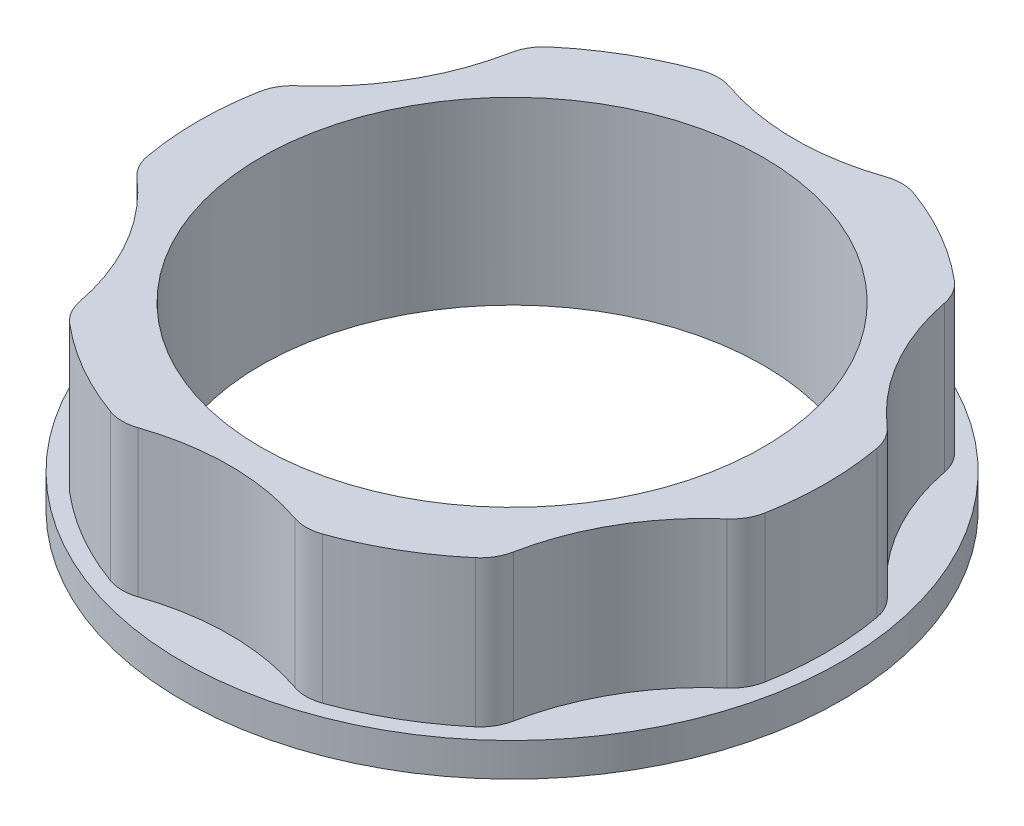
from build123d import *
from build123d.topology import SkipClean

# Parameters (mm, degrees)
ESQUISSE1_R        = 12
BOSS_EXTRU_1_DEPTH = 7
BOSS_EXTRU_2_START = 1.6
ESQUISSE2_R        = 15.75
ESQUISSE2_R_2      = 12
BOSS_EXTRU_2_DEPTH = 1.6


with BuildPart() as part:
    # Esquisse1 → Boss.-Extru.1 (new body)
    with BuildSketch(Plane(origin=(0, 0, 0), x_dir=(1, 0, 0), z_dir=(0, 1, 0))):
        with BuildLine():
            ThreePointArc((-5.069676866, 14.117307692), (-7.5, 12.990381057), (-9.691108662, 11.449122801))
            ThreePointArc((-9.691108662, 11.449122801), (-10.12433899, 10.934042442), (-10.362171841, 10.304414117))
            ThreePointArc((-10.362171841, 10.304414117), (-11.691342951, 6.75), (-14.104970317, 3.821696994))
            ThreePointArc((-14.104970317, 3.821696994), (-14.531328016, 3.30091354), (-14.760785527, 2.668184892))
            ThreePointArc((-14.760785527, 2.668184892), (-15, 0), (-14.760785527, -2.668184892))
            ThreePointArc((-14.760785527, -2.668184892), (-14.531328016, -3.30091354), (-14.104970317, -3.821696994))
            ThreePointArc((-14.104970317, -3.821696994), (-11.691342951, -6.75), (-10.362171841, -10.304414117))
            ThreePointArc((-10.362171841, -10.304414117), (-10.12433899, -10.934042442), (-9.691108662, -11.449122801))
            ThreePointArc((-9.691108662, -11.449122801), (-7.5, -12.990381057), (-5.069676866, -14.117307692))
            ThreePointArc((-5.069676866, -14.117307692), (-4.406989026, -14.234955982), (-3.742798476, -14.126111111))
            ThreePointArc((-3.742798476, -14.126111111), (0, -13.5), (3.742798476, -14.126111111))
            ThreePointArc((3.742798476, -14.126111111), (4.406989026, -14.234955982), (5.069676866, -14.117307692))
            ThreePointArc((5.069676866, -14.117307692), (7.5, -12.990381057), (9.691108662, -11.449122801))
            ThreePointArc((9.691108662, -11.449122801), (10.12433899, -10.934042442), (10.362171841, -10.304414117))
            ThreePointArc((10.362171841, -10.304414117), (11.691342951, -6.75), (14.104970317, -3.821696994))
            ThreePointArc((14.104970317, -3.821696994), (14.531328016, -3.30091354), (14.760785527, -2.668184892))
            ThreePointArc((14.760785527, -2.668184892), (15, 0), (14.760785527, 2.668184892))
            ThreePointArc((14.760785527, 2.668184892), (14.531328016, 3.30091354), (14.104970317, 3.821696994))
            ThreePointArc((14.104970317, 3.821696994), (11.691342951, 6.75), (10.362171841, 10.304414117))
            ThreePointArc((10.362171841, 10.304414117), (10.12433899, 10.934042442), (9.691108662, 11.449122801))
            ThreePointArc((9.691108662, 11.449122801), (7.5, 12.990381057), (5.069676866, 14.117307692))
            ThreePointArc((5.069676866, 14.117307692), (4.406989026, 14.234955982), (3.742798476, 14.126111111))
            ThreePointArc((3.742798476, 14.126111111), (0, 13.5), (-3.742798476, 14.126111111))
            ThreePointArc((-3.742798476, 14.126111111), (-4.406989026, 14.234955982), (-5.069676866, 14.117307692))
        make_face()
        with Locations(Location((0, 0, 0), (0, 0, 270))):
            Circle(ESQUISSE1_R, mode=Mode.SUBTRACT)
    extrude(amount=BOSS_EXTRU_1_DEPTH)

    # Esquisse2 → Boss.-Extru.2 (add)
    with SkipClean():  # the faces are left unmerged after this step: merging them gives an invalid solid
        with BuildSketch(Plane.XZ.offset(BOSS_EXTRU_2_START)):
            with Locations(Location((0, 0, 0), (0, 0, 270))):
                Circle(ESQUISSE2_R)
            with Locations(Location((0, 0, 0), (0, 0, 270))):
                Circle(ESQUISSE2_R_2, mode=Mode.SUBTRACT)
        extrude(amount=-BOSS_EXTRU_2_DEPTH)


solid = part.part
